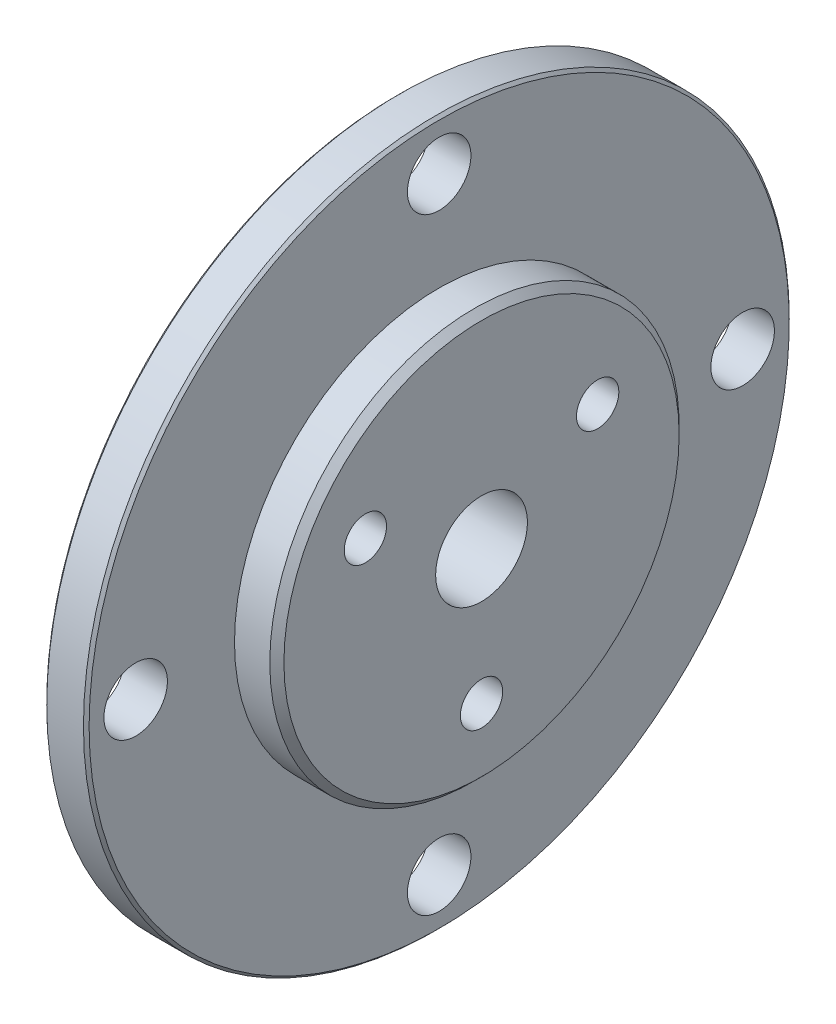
ISO-10303-21;
HEADER;
FILE_DESCRIPTION(('STEP AP214'),'2;1');
FILE_NAME('part.step','',(''),(''),'','','');
FILE_SCHEMA(('AUTOMOTIVE_DESIGN { 1 0 10303 214 1 1 1 1 }'));
ENDSEC;
DATA;
#1=APPLICATION_CONTEXT('core data for automotive mechanical design processes');
#2=APPLICATION_PROTOCOL_DEFINITION('international standard','automotive_design',2000,#1);
#3=PRODUCT_CONTEXT('',#1,'mechanical');
#4=PRODUCT('Part','Part','',(#3));
#5=PRODUCT_RELATED_PRODUCT_CATEGORY('part','',(#4));
#6=PRODUCT_DEFINITION_FORMATION('','',#4);
#7=PRODUCT_DEFINITION_CONTEXT('part definition',#1,'design');
#8=PRODUCT_DEFINITION('design','',#6,#7);
#9=PRODUCT_DEFINITION_SHAPE('','',#8);
#10=(LENGTH_UNIT() NAMED_UNIT(*) SI_UNIT(.MILLI.,.METRE.));
#11=(NAMED_UNIT(*) PLANE_ANGLE_UNIT() SI_UNIT($,.RADIAN.));
#12=(NAMED_UNIT(*) SI_UNIT($,.STERADIAN.) SOLID_ANGLE_UNIT());
#13=UNCERTAINTY_MEASURE_WITH_UNIT(LENGTH_MEASURE(1.E-05),#10,'distance_accuracy_value','');
#14=(GEOMETRIC_REPRESENTATION_CONTEXT(3) GLOBAL_UNCERTAINTY_ASSIGNED_CONTEXT((#13)) GLOBAL_UNIT_ASSIGNED_CONTEXT((#10,
#11,#12)) REPRESENTATION_CONTEXT('',''));
#15=CARTESIAN_POINT('',(0.,0.,0.));
#16=DIRECTION('',(0.,0.,1.));
#17=DIRECTION('',(1.,0.,0.));
#18=AXIS2_PLACEMENT_3D('',#15,#16,#17);
#19=CARTESIAN_POINT('',(-30.7302294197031,0.,0.));
#20=DIRECTION('',(-1.,0.,0.));
#21=DIRECTION('',(0.,0.,1.));
#22=AXIS2_PLACEMENT_3D('',#19,#20,#21);
#23=CYLINDRICAL_SURFACE('',#22,25.);
#24=CARTESIAN_POINT('',(-2.80000000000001,0.,0.));
#25=DIRECTION('',(1.,0.,0.));
#26=DIRECTION('',(0.,0.,-1.));
#27=AXIS2_PLACEMENT_3D('',#24,#25,#26);
#28=CIRCLE('',#27,25.);
#29=CARTESIAN_POINT('',(-2.80000000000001,0.,-25.));
#30=VERTEX_POINT('',#29);
#31=EDGE_CURVE('E38',#30,#30,#28,.T.);
#32=ORIENTED_EDGE('',*,*,#31,.T.);
#33=EDGE_LOOP('',(#32));
#34=FACE_BOUND('',#33,.T.);
#35=CARTESIAN_POINT('',(-0.199999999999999,0.,0.));
#36=DIRECTION('',(-1.,0.,0.));
#37=DIRECTION('',(0.,0.,1.));
#38=AXIS2_PLACEMENT_3D('',#35,#36,#37);
#39=CIRCLE('',#38,25.);
#40=CARTESIAN_POINT('',(-0.199999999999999,0.,25.));
#41=VERTEX_POINT('',#40);
#42=EDGE_CURVE('E42',#41,#41,#39,.T.);
#43=ORIENTED_EDGE('',*,*,#42,.T.);
#44=EDGE_LOOP('',(#43));
#45=FACE_BOUND('',#44,.T.);
#46=ADVANCED_FACE('F32',(#34,#45),#23,.T.);
#47=CARTESIAN_POINT('',(0.,25.,0.));
#48=DIRECTION('',(-1.,0.,0.));
#49=DIRECTION('',(0.,0.,1.));
#50=AXIS2_PLACEMENT_3D('',#47,#48,#49);
#51=PLANE('',#50);
#52=CARTESIAN_POINT('',(0.,2.25200676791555E-13,21.5));
#53=DIRECTION('',(-1.,0.,0.));
#54=DIRECTION('',(0.,0.,1.));
#55=AXIS2_PLACEMENT_3D('',#52,#53,#54);
#56=CIRCLE('',#55,2.25);
#57=CARTESIAN_POINT('',(0.,2.25200676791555E-13,23.75));
#58=VERTEX_POINT('',#57);
#59=EDGE_CURVE('E102',#58,#58,#56,.T.);
#60=ORIENTED_EDGE('',*,*,#59,.T.);
#61=EDGE_LOOP('',(#60));
#62=FACE_BOUND('',#61,.T.);
#63=CARTESIAN_POINT('',(0.,-21.5,1.50133784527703E-13));
#64=DIRECTION('',(-1.,0.,0.));
#65=DIRECTION('',(0.,0.,1.));
#66=AXIS2_PLACEMENT_3D('',#63,#64,#65);
#67=CIRCLE('',#66,2.25);
#68=CARTESIAN_POINT('',(0.,-21.5,2.25000000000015));
#69=VERTEX_POINT('',#68);
#70=EDGE_CURVE('E96',#69,#69,#67,.T.);
#71=ORIENTED_EDGE('',*,*,#70,.T.);
#72=EDGE_LOOP('',(#71));
#73=FACE_BOUND('',#72,.T.);
#74=CARTESIAN_POINT('',(0.,0.,-21.5));
#75=DIRECTION('',(-1.,0.,0.));
#76=DIRECTION('',(0.,0.,1.));
#77=AXIS2_PLACEMENT_3D('',#74,#75,#76);
#78=CIRCLE('',#77,2.25);
#79=CARTESIAN_POINT('',(0.,0.,-19.25));
#80=VERTEX_POINT('',#79);
#81=EDGE_CURVE('E90',#80,#80,#78,.T.);
#82=ORIENTED_EDGE('',*,*,#81,.T.);
#83=EDGE_LOOP('',(#82));
#84=FACE_BOUND('',#83,.T.);
#85=CARTESIAN_POINT('',(0.,21.5,0.));
#86=DIRECTION('',(-1.,0.,0.));
#87=DIRECTION('',(0.,0.,1.));
#88=AXIS2_PLACEMENT_3D('',#85,#86,#87);
#89=CIRCLE('',#88,2.25);
#90=CARTESIAN_POINT('',(0.,21.5,2.25));
#91=VERTEX_POINT('',#90);
#92=EDGE_CURVE('E84',#91,#91,#89,.T.);
#93=ORIENTED_EDGE('',*,*,#92,.T.);
#94=EDGE_LOOP('',(#93));
#95=FACE_BOUND('',#94,.T.);
#96=CARTESIAN_POINT('',(0.,0.,0.));
#97=DIRECTION('',(-1.,0.,0.));
#98=DIRECTION('',(0.,0.,1.));
#99=AXIS2_PLACEMENT_3D('',#96,#97,#98);
#100=CIRCLE('',#99,24.8);
#101=CARTESIAN_POINT('',(0.,0.,24.8));
#102=VERTEX_POINT('',#101);
#103=EDGE_CURVE('E10',#102,#102,#100,.F.);
#104=ORIENTED_EDGE('',*,*,#103,.T.);
#105=EDGE_LOOP('',(#104));
#106=FACE_BOUND('',#105,.T.);
#107=CARTESIAN_POINT('',(0.,0.,0.));
#108=DIRECTION('',(-1.,0.,0.));
#109=DIRECTION('',(0.,0.,1.));
#110=AXIS2_PLACEMENT_3D('',#107,#108,#109);
#111=CIRCLE('',#110,14.5);
#112=CARTESIAN_POINT('',(0.,0.,14.5));
#113=VERTEX_POINT('',#112);
#114=EDGE_CURVE('E57',#113,#113,#111,.T.);
#115=ORIENTED_EDGE('',*,*,#114,.T.);
#116=EDGE_LOOP('',(#115));
#117=FACE_BOUND('',#116,.T.);
#118=ADVANCED_FACE('F146',(#62,#73,#84,#95,#106,#117),#51,.F.);
#119=CARTESIAN_POINT('',(-30.7302294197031,0.,0.));
#120=DIRECTION('',(-1.,0.,0.));
#121=DIRECTION('',(0.,0.,1.));
#122=AXIS2_PLACEMENT_3D('',#119,#120,#121);
#123=CYLINDRICAL_SURFACE('',#122,14.5);
#124=CARTESIAN_POINT('',(2.5,0.,0.));
#125=DIRECTION('',(-1.,0.,0.));
#126=DIRECTION('',(0.,0.,1.));
#127=AXIS2_PLACEMENT_3D('',#124,#125,#126);
#128=CIRCLE('',#127,14.5);
#129=CARTESIAN_POINT('',(2.5,0.,14.5));
#130=VERTEX_POINT('',#129);
#131=EDGE_CURVE('E54',#130,#130,#128,.T.);
#132=ORIENTED_EDGE('',*,*,#131,.T.);
#133=EDGE_LOOP('',(#132));
#134=FACE_BOUND('',#133,.T.);
#135=ORIENTED_EDGE('',*,*,#114,.F.);
#136=EDGE_LOOP('',(#135));
#137=FACE_BOUND('',#136,.T.);
#138=ADVANCED_FACE('F141',(#134,#137),#123,.T.);
#139=CARTESIAN_POINT('',(3.,14.5,0.));
#140=DIRECTION('',(-1.,0.,0.));
#141=DIRECTION('',(0.,0.,1.));
#142=AXIS2_PLACEMENT_3D('',#139,#140,#141);
#143=PLANE('',#142);
#144=CARTESIAN_POINT('',(3.,-9.5,0.));
#145=DIRECTION('',(1.,0.,0.));
#146=DIRECTION('',(0.,0.866025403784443,0.499999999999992));
#147=AXIS2_PLACEMENT_3D('',#144,#145,#146);
#148=CIRCLE('',#147,1.5);
#149=CARTESIAN_POINT('',(3.,-8.20096189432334,0.750000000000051));
#150=VERTEX_POINT('',#149);
#151=EDGE_CURVE('E81',#150,#150,#148,.T.);
#152=ORIENTED_EDGE('',*,*,#151,.F.);
#153=EDGE_LOOP('',(#152));
#154=FACE_BOUND('',#153,.T.);
#155=CARTESIAN_POINT('',(3.,4.74999999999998,-8.22724133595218));
#156=DIRECTION('',(1.,0.,0.));
#157=DIRECTION('',(0.,-0.866025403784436,0.500000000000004));
#158=AXIS2_PLACEMENT_3D('',#155,#156,#157);
#159=CIRCLE('',#158,1.5);
#160=CARTESIAN_POINT('',(3.,3.45096189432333,-7.47724133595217));
#161=VERTEX_POINT('',#160);
#162=EDGE_CURVE('E75',#161,#161,#159,.T.);
#163=ORIENTED_EDGE('',*,*,#162,.F.);
#164=EDGE_LOOP('',(#163));
#165=FACE_BOUND('',#164,.T.);
#166=CARTESIAN_POINT('',(3.,4.74999999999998,8.22724133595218));
#167=DIRECTION('',(1.,0.,0.));
#168=DIRECTION('',(0.,0.,-1.));
#169=AXIS2_PLACEMENT_3D('',#166,#167,#168);
#170=CIRCLE('',#169,1.5);
#171=CARTESIAN_POINT('',(3.,4.74999999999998,6.72724133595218));
#172=VERTEX_POINT('',#171);
#173=EDGE_CURVE('E69',#172,#172,#170,.T.);
#174=ORIENTED_EDGE('',*,*,#173,.F.);
#175=EDGE_LOOP('',(#174));
#176=FACE_BOUND('',#175,.T.);
#177=CARTESIAN_POINT('',(3.,0.,0.));
#178=DIRECTION('',(-1.,0.,0.));
#179=DIRECTION('',(0.,0.,1.));
#180=AXIS2_PLACEMENT_3D('',#177,#178,#179);
#181=CIRCLE('',#180,14.);
#182=CARTESIAN_POINT('',(3.,0.,14.));
#183=VERTEX_POINT('',#182);
#184=EDGE_CURVE('E51',#183,#183,#181,.F.);
#185=ORIENTED_EDGE('',*,*,#184,.T.);
#186=EDGE_LOOP('',(#185));
#187=FACE_BOUND('',#186,.T.);
#188=CARTESIAN_POINT('',(3.,0.,0.));
#189=DIRECTION('',(-1.,0.,0.));
#190=DIRECTION('',(0.,0.,1.));
#191=AXIS2_PLACEMENT_3D('',#188,#189,#190);
#192=CIRCLE('',#191,3.25);
#193=CARTESIAN_POINT('',(3.,0.,3.25));
#194=VERTEX_POINT('',#193);
#195=EDGE_CURVE('E60',#194,#194,#192,.T.);
#196=ORIENTED_EDGE('',*,*,#195,.T.);
#197=EDGE_LOOP('',(#196));
#198=FACE_BOUND('',#197,.T.);
#199=ADVANCED_FACE('F135',(#154,#165,#176,#187,#198),#143,.F.);
#200=CARTESIAN_POINT('',(-30.7302294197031,0.,0.));
#201=DIRECTION('',(-1.,0.,0.));
#202=DIRECTION('',(0.,0.,1.));
#203=AXIS2_PLACEMENT_3D('',#200,#201,#202);
#204=CYLINDRICAL_SURFACE('',#203,3.25);
#205=ORIENTED_EDGE('',*,*,#195,.F.);
#206=EDGE_LOOP('',(#205));
#207=FACE_BOUND('',#206,.T.);
#208=CARTESIAN_POINT('',(-3.,0.,0.));
#209=DIRECTION('',(-1.,0.,0.));
#210=DIRECTION('',(0.,0.,1.));
#211=AXIS2_PLACEMENT_3D('',#208,#209,#210);
#212=CIRCLE('',#211,3.25);
#213=CARTESIAN_POINT('',(-3.,0.,3.25));
#214=VERTEX_POINT('',#213);
#215=EDGE_CURVE('E63',#214,#214,#212,.T.);
#216=ORIENTED_EDGE('',*,*,#215,.T.);
#217=EDGE_LOOP('',(#216));
#218=FACE_BOUND('',#217,.T.);
#219=ADVANCED_FACE('F116',(#207,#218),#204,.F.);
#220=CARTESIAN_POINT('',(-3.,3.25,0.));
#221=DIRECTION('',(1.,0.,0.));
#222=DIRECTION('',(0.,0.,-1.));
#223=AXIS2_PLACEMENT_3D('',#220,#221,#222);
#224=PLANE('',#223);
#225=CARTESIAN_POINT('',(-3.,2.25200676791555E-13,21.5));
#226=DIRECTION('',(-1.,0.,0.));
#227=DIRECTION('',(0.,-1.,0.));
#228=AXIS2_PLACEMENT_3D('',#225,#226,#227);
#229=CIRCLE('',#228,2.25);
#230=CARTESIAN_POINT('',(-3.,-2.24999999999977,21.5));
#231=VERTEX_POINT('',#230);
#232=EDGE_CURVE('E105',#231,#231,#229,.T.);
#233=ORIENTED_EDGE('',*,*,#232,.F.);
#234=EDGE_LOOP('',(#233));
#235=FACE_BOUND('',#234,.T.);
#236=CARTESIAN_POINT('',(-3.,-21.5,1.50133784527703E-13));
#237=DIRECTION('',(-1.,0.,0.));
#238=DIRECTION('',(0.,0.,-1.));
#239=AXIS2_PLACEMENT_3D('',#236,#237,#238);
#240=CIRCLE('',#239,2.25);
#241=CARTESIAN_POINT('',(-3.,-21.5,-2.24999999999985));
#242=VERTEX_POINT('',#241);
#243=EDGE_CURVE('E99',#242,#242,#240,.T.);
#244=ORIENTED_EDGE('',*,*,#243,.F.);
#245=EDGE_LOOP('',(#244));
#246=FACE_BOUND('',#245,.T.);
#247=CARTESIAN_POINT('',(-3.,0.,-21.5));
#248=DIRECTION('',(-1.,0.,0.));
#249=DIRECTION('',(0.,1.,0.));
#250=AXIS2_PLACEMENT_3D('',#247,#248,#249);
#251=CIRCLE('',#250,2.25);
#252=CARTESIAN_POINT('',(-3.,2.24999999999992,-21.5));
#253=VERTEX_POINT('',#252);
#254=EDGE_CURVE('E93',#253,#253,#251,.T.);
#255=ORIENTED_EDGE('',*,*,#254,.F.);
#256=EDGE_LOOP('',(#255));
#257=FACE_BOUND('',#256,.T.);
#258=CARTESIAN_POINT('',(-3.,21.5,0.));
#259=DIRECTION('',(-1.,0.,0.));
#260=DIRECTION('',(0.,0.,1.));
#261=AXIS2_PLACEMENT_3D('',#258,#259,#260);
#262=CIRCLE('',#261,2.25);
#263=CARTESIAN_POINT('',(-3.,21.5,2.25));
#264=VERTEX_POINT('',#263);
#265=EDGE_CURVE('E87',#264,#264,#262,.T.);
#266=ORIENTED_EDGE('',*,*,#265,.F.);
#267=EDGE_LOOP('',(#266));
#268=FACE_BOUND('',#267,.T.);
#269=CARTESIAN_POINT('',(-3.,-9.5,0.));
#270=DIRECTION('',(1.,0.,0.));
#271=DIRECTION('',(0.,0.866025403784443,0.499999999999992));
#272=AXIS2_PLACEMENT_3D('',#269,#270,#271);
#273=CIRCLE('',#272,1.5);
#274=CARTESIAN_POINT('',(-3.,-8.20096189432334,0.750000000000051));
#275=VERTEX_POINT('',#274);
#276=EDGE_CURVE('E78',#275,#275,#273,.T.);
#277=ORIENTED_EDGE('',*,*,#276,.T.);
#278=EDGE_LOOP('',(#277));
#279=FACE_BOUND('',#278,.T.);
#280=CARTESIAN_POINT('',(-3.,4.74999999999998,-8.22724133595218));
#281=DIRECTION('',(1.,0.,0.));
#282=DIRECTION('',(0.,-0.866025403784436,0.500000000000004));
#283=AXIS2_PLACEMENT_3D('',#280,#281,#282);
#284=CIRCLE('',#283,1.5);
#285=CARTESIAN_POINT('',(-3.,3.45096189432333,-7.47724133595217));
#286=VERTEX_POINT('',#285);
#287=EDGE_CURVE('E72',#286,#286,#284,.T.);
#288=ORIENTED_EDGE('',*,*,#287,.T.);
#289=EDGE_LOOP('',(#288));
#290=FACE_BOUND('',#289,.T.);
#291=CARTESIAN_POINT('',(-3.,4.74999999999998,8.22724133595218));
#292=DIRECTION('',(1.,0.,0.));
#293=DIRECTION('',(0.,0.,-1.));
#294=AXIS2_PLACEMENT_3D('',#291,#292,#293);
#295=CIRCLE('',#294,1.5);
#296=CARTESIAN_POINT('',(-3.,4.74999999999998,6.72724133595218));
#297=VERTEX_POINT('',#296);
#298=EDGE_CURVE('E66',#297,#297,#295,.T.);
#299=ORIENTED_EDGE('',*,*,#298,.T.);
#300=EDGE_LOOP('',(#299));
#301=FACE_BOUND('',#300,.T.);
#302=CARTESIAN_POINT('',(-3.,0.,0.));
#303=DIRECTION('',(1.,0.,0.));
#304=DIRECTION('',(0.,0.,-1.));
#305=AXIS2_PLACEMENT_3D('',#302,#303,#304);
#306=CIRCLE('',#305,24.8);
#307=CARTESIAN_POINT('',(-3.,0.,-24.8));
#308=VERTEX_POINT('',#307);
#309=EDGE_CURVE('E46',#308,#308,#306,.F.);
#310=ORIENTED_EDGE('',*,*,#309,.T.);
#311=EDGE_LOOP('',(#310));
#312=FACE_BOUND('',#311,.T.);
#313=ORIENTED_EDGE('',*,*,#215,.F.);
#314=EDGE_LOOP('',(#313));
#315=FACE_BOUND('',#314,.T.);
#316=ADVANCED_FACE('F112',(#235,#246,#257,#268,#279,#290,#301,#312,#315),#224,.F.);
#317=CARTESIAN_POINT('',(2.5,0.,0.));
#318=DIRECTION('',(-1.,0.,0.));
#319=DIRECTION('',(0.,0.,1.));
#320=AXIS2_PLACEMENT_3D('',#317,#318,#319);
#321=CONICAL_SURFACE('',#320,14.5,0.78539816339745);
#322=ORIENTED_EDGE('',*,*,#184,.F.);
#323=EDGE_LOOP('',(#322));
#324=FACE_BOUND('',#323,.T.);
#325=ORIENTED_EDGE('',*,*,#131,.F.);
#326=EDGE_LOOP('',(#325));
#327=FACE_BOUND('',#326,.T.);
#328=ADVANCED_FACE('F115',(#324,#327),#321,.T.);
#329=CARTESIAN_POINT('',(-3.,0.,0.));
#330=DIRECTION('',(1.,0.,0.));
#331=DIRECTION('',(0.,0.,-1.));
#332=AXIS2_PLACEMENT_3D('',#329,#330,#331);
#333=CONICAL_SURFACE('',#332,24.8,0.785398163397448);
#334=ORIENTED_EDGE('',*,*,#31,.F.);
#335=EDGE_LOOP('',(#334));
#336=FACE_BOUND('',#335,.T.);
#337=ORIENTED_EDGE('',*,*,#309,.F.);
#338=EDGE_LOOP('',(#337));
#339=FACE_BOUND('',#338,.T.);
#340=ADVANCED_FACE('F157',(#336,#339),#333,.T.);
#341=CARTESIAN_POINT('',(-0.199999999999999,0.,0.));
#342=DIRECTION('',(-1.,0.,0.));
#343=DIRECTION('',(0.,0.,1.));
#344=AXIS2_PLACEMENT_3D('',#341,#342,#343);
#345=CONICAL_SURFACE('',#344,25.,0.785398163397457);
#346=ORIENTED_EDGE('',*,*,#103,.F.);
#347=EDGE_LOOP('',(#346));
#348=FACE_BOUND('',#347,.T.);
#349=ORIENTED_EDGE('',*,*,#42,.F.);
#350=EDGE_LOOP('',(#349));
#351=FACE_BOUND('',#350,.T.);
#352=ADVANCED_FACE('F154',(#348,#351),#345,.T.);
#353=CARTESIAN_POINT('',(-3.,4.74999999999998,8.22724133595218));
#354=DIRECTION('',(1.,0.,0.));
#355=DIRECTION('',(0.,0.,-1.));
#356=AXIS2_PLACEMENT_3D('',#353,#354,#355);
#357=CYLINDRICAL_SURFACE('',#356,1.5);
#358=ORIENTED_EDGE('',*,*,#298,.F.);
#359=EDGE_LOOP('',(#358));
#360=FACE_BOUND('',#359,.T.);
#361=ORIENTED_EDGE('',*,*,#173,.T.);
#362=EDGE_LOOP('',(#361));
#363=FACE_BOUND('',#362,.T.);
#364=ADVANCED_FACE('F156',(#360,#363),#357,.F.);
#365=CARTESIAN_POINT('',(-3.,4.74999999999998,-8.22724133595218));
#366=DIRECTION('',(1.,0.,0.));
#367=DIRECTION('',(0.,0.,-1.));
#368=AXIS2_PLACEMENT_3D('',#365,#366,#367);
#369=CYLINDRICAL_SURFACE('',#368,1.5);
#370=ORIENTED_EDGE('',*,*,#287,.F.);
#371=EDGE_LOOP('',(#370));
#372=FACE_BOUND('',#371,.T.);
#373=ORIENTED_EDGE('',*,*,#162,.T.);
#374=EDGE_LOOP('',(#373));
#375=FACE_BOUND('',#374,.T.);
#376=ADVANCED_FACE('F164',(#372,#375),#369,.F.);
#377=CARTESIAN_POINT('',(-3.,-9.5,0.));
#378=DIRECTION('',(1.,0.,0.));
#379=DIRECTION('',(0.,0.,-1.));
#380=AXIS2_PLACEMENT_3D('',#377,#378,#379);
#381=CYLINDRICAL_SURFACE('',#380,1.5);
#382=ORIENTED_EDGE('',*,*,#276,.F.);
#383=EDGE_LOOP('',(#382));
#384=FACE_BOUND('',#383,.T.);
#385=ORIENTED_EDGE('',*,*,#151,.T.);
#386=EDGE_LOOP('',(#385));
#387=FACE_BOUND('',#386,.T.);
#388=ADVANCED_FACE('F205',(#384,#387),#381,.F.);
#389=CARTESIAN_POINT('',(3.,21.5,0.));
#390=DIRECTION('',(-1.,0.,0.));
#391=DIRECTION('',(0.,0.,1.));
#392=AXIS2_PLACEMENT_3D('',#389,#390,#391);
#393=CYLINDRICAL_SURFACE('',#392,2.25);
#394=ORIENTED_EDGE('',*,*,#265,.T.);
#395=EDGE_LOOP('',(#394));
#396=FACE_BOUND('',#395,.T.);
#397=ORIENTED_EDGE('',*,*,#92,.F.);
#398=EDGE_LOOP('',(#397));
#399=FACE_BOUND('',#398,.T.);
#400=ADVANCED_FACE('F214',(#396,#399),#393,.F.);
#401=CARTESIAN_POINT('',(3.,0.,-21.5));
#402=DIRECTION('',(-1.,0.,0.));
#403=DIRECTION('',(0.,0.,1.));
#404=AXIS2_PLACEMENT_3D('',#401,#402,#403);
#405=CYLINDRICAL_SURFACE('',#404,2.25);
#406=ORIENTED_EDGE('',*,*,#254,.T.);
#407=EDGE_LOOP('',(#406));
#408=FACE_BOUND('',#407,.T.);
#409=ORIENTED_EDGE('',*,*,#81,.F.);
#410=EDGE_LOOP('',(#409));
#411=FACE_BOUND('',#410,.T.);
#412=ADVANCED_FACE('F223',(#408,#411),#405,.F.);
#413=CARTESIAN_POINT('',(3.,-21.5,1.50133784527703E-13));
#414=DIRECTION('',(-1.,0.,0.));
#415=DIRECTION('',(0.,0.,1.));
#416=AXIS2_PLACEMENT_3D('',#413,#414,#415);
#417=CYLINDRICAL_SURFACE('',#416,2.25);
#418=ORIENTED_EDGE('',*,*,#243,.T.);
#419=EDGE_LOOP('',(#418));
#420=FACE_BOUND('',#419,.T.);
#421=ORIENTED_EDGE('',*,*,#70,.F.);
#422=EDGE_LOOP('',(#421));
#423=FACE_BOUND('',#422,.T.);
#424=ADVANCED_FACE('F246',(#420,#423),#417,.F.);
#425=CARTESIAN_POINT('',(3.,2.25200676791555E-13,21.5));
#426=DIRECTION('',(-1.,0.,0.));
#427=DIRECTION('',(0.,0.,1.));
#428=AXIS2_PLACEMENT_3D('',#425,#426,#427);
#429=CYLINDRICAL_SURFACE('',#428,2.25);
#430=ORIENTED_EDGE('',*,*,#232,.T.);
#431=EDGE_LOOP('',(#430));
#432=FACE_BOUND('',#431,.T.);
#433=ORIENTED_EDGE('',*,*,#59,.F.);
#434=EDGE_LOOP('',(#433));
#435=FACE_BOUND('',#434,.T.);
#436=ADVANCED_FACE('F109',(#432,#435),#429,.F.);
#437=CLOSED_SHELL('',(#46,#118,#138,#199,#219,#316,#328,#340,#352,#364,#376,#388,#400,#412,#424,#436));
#438=MANIFOLD_SOLID_BREP('B2',#437);
#439=ADVANCED_BREP_SHAPE_REPRESENTATION('',(#18,#438),#14);
#440=SHAPE_DEFINITION_REPRESENTATION(#9,#439);
ENDSEC;
END-ISO-10303-21;
